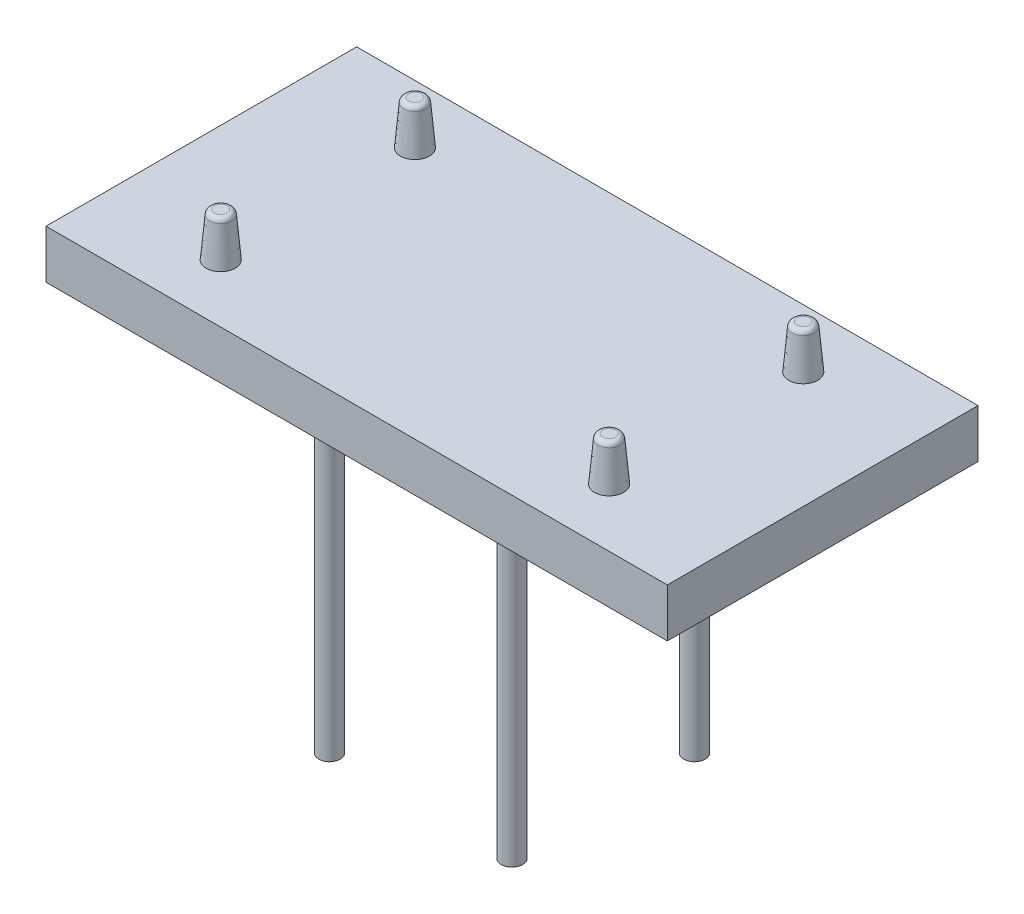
ISO-10303-21;
HEADER;
FILE_DESCRIPTION(('STEP AP214'),'2;1');
FILE_NAME('part.step','',(''),(''),'','','');
FILE_SCHEMA(('AUTOMOTIVE_DESIGN { 1 0 10303 214 1 1 1 1 }'));
ENDSEC;
DATA;
#1=APPLICATION_CONTEXT('core data for automotive mechanical design processes');
#2=APPLICATION_PROTOCOL_DEFINITION('international standard','automotive_design',2000,#1);
#3=PRODUCT_CONTEXT('',#1,'mechanical');
#4=PRODUCT('Part','Part','',(#3));
#5=PRODUCT_RELATED_PRODUCT_CATEGORY('part','',(#4));
#6=PRODUCT_DEFINITION_FORMATION('','',#4);
#7=PRODUCT_DEFINITION_CONTEXT('part definition',#1,'design');
#8=PRODUCT_DEFINITION('design','',#6,#7);
#9=PRODUCT_DEFINITION_SHAPE('','',#8);
#10=(LENGTH_UNIT() NAMED_UNIT(*) SI_UNIT(.MILLI.,.METRE.));
#11=(NAMED_UNIT(*) PLANE_ANGLE_UNIT() SI_UNIT($,.RADIAN.));
#12=(NAMED_UNIT(*) SI_UNIT($,.STERADIAN.) SOLID_ANGLE_UNIT());
#13=UNCERTAINTY_MEASURE_WITH_UNIT(LENGTH_MEASURE(1.E-05),#10,'distance_accuracy_value','');
#14=(GEOMETRIC_REPRESENTATION_CONTEXT(3) GLOBAL_UNCERTAINTY_ASSIGNED_CONTEXT((#13)) GLOBAL_UNIT_ASSIGNED_CONTEXT((#10,
#11,#12)) REPRESENTATION_CONTEXT('',''));
#15=CARTESIAN_POINT('',(0.,0.,0.));
#16=DIRECTION('',(0.,0.,1.));
#17=DIRECTION('',(1.,0.,0.));
#18=AXIS2_PLACEMENT_3D('',#15,#16,#17);
#19=CARTESIAN_POINT('',(-160.,-25.,80.));
#20=DIRECTION('',(0.,1.,0.));
#21=DIRECTION('',(0.,0.,1.));
#22=AXIS2_PLACEMENT_3D('',#19,#20,#21);
#23=PLANE('',#22);
#24=CARTESIAN_POINT('',(47.,-25.,47.));
#25=DIRECTION('',(0.,1.,0.));
#26=DIRECTION('',(0.,0.,1.));
#27=AXIS2_PLACEMENT_3D('',#24,#25,#26);
#28=CIRCLE('',#27,10.5);
#29=CARTESIAN_POINT('',(47.,-25.,57.5));
#30=VERTEX_POINT('',#29);
#31=EDGE_CURVE('E161',#30,#30,#28,.F.);
#32=ORIENTED_EDGE('',*,*,#31,.F.);
#33=EDGE_LOOP('',(#32));
#34=FACE_BOUND('',#33,.T.);
#35=CARTESIAN_POINT('',(-47.,-25.,-47.));
#36=DIRECTION('',(0.,1.,0.));
#37=DIRECTION('',(0.,0.,1.));
#38=AXIS2_PLACEMENT_3D('',#35,#36,#37);
#39=CIRCLE('',#38,10.5);
#40=CARTESIAN_POINT('',(-47.,-25.,-36.5));
#41=VERTEX_POINT('',#40);
#42=EDGE_CURVE('E147',#41,#41,#39,.F.);
#43=ORIENTED_EDGE('',*,*,#42,.F.);
#44=EDGE_LOOP('',(#43));
#45=FACE_BOUND('',#44,.T.);
#46=CARTESIAN_POINT('',(0.,-25.,0.));
#47=DIRECTION('',(0.,1.,0.));
#48=DIRECTION('',(0.,0.,1.));
#49=AXIS2_PLACEMENT_3D('',#46,#47,#48);
#50=CIRCLE('',#49,39.9999999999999);
#51=CARTESIAN_POINT('',(0.,-25.,39.9999999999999));
#52=VERTEX_POINT('',#51);
#53=EDGE_CURVE('E144',#52,#52,#50,.T.);
#54=ORIENTED_EDGE('',*,*,#53,.T.);
#55=EDGE_LOOP('',(#54));
#56=FACE_BOUND('',#55,.T.);
#57=DIRECTION('',(0.,0.,1.));
#58=VECTOR('',#57,1.);
#59=CARTESIAN_POINT('',(-160.,-25.,-80.));
#60=LINE('',#59,#58);
#61=CARTESIAN_POINT('',(-160.,-25.,-80.));
#62=VERTEX_POINT('',#61);
#63=CARTESIAN_POINT('',(-160.,-25.,80.));
#64=VERTEX_POINT('',#63);
#65=EDGE_CURVE('E100',#62,#64,#60,.T.);
#66=ORIENTED_EDGE('',*,*,#65,.F.);
#67=DIRECTION('',(1.,0.,0.));
#68=VECTOR('',#67,1.);
#69=CARTESIAN_POINT('',(-160.,-25.,-80.));
#70=LINE('',#69,#68);
#71=CARTESIAN_POINT('',(160.,-25.,-80.));
#72=VERTEX_POINT('',#71);
#73=EDGE_CURVE('E88',#62,#72,#70,.T.);
#74=ORIENTED_EDGE('',*,*,#73,.T.);
#75=DIRECTION('',(0.,0.,1.));
#76=VECTOR('',#75,1.);
#77=CARTESIAN_POINT('',(160.,-25.,-80.));
#78=LINE('',#77,#76);
#79=CARTESIAN_POINT('',(160.,-25.,80.));
#80=VERTEX_POINT('',#79);
#81=EDGE_CURVE('E83',#72,#80,#78,.T.);
#82=ORIENTED_EDGE('',*,*,#81,.T.);
#83=DIRECTION('',(1.,0.,0.));
#84=VECTOR('',#83,1.);
#85=CARTESIAN_POINT('',(-160.,-25.,80.));
#86=LINE('',#85,#84);
#87=EDGE_CURVE('E87',#64,#80,#86,.T.);
#88=ORIENTED_EDGE('',*,*,#87,.F.);
#89=EDGE_LOOP('',(#66,#74,#82,#88));
#90=FACE_BOUND('',#89,.T.);
#91=CARTESIAN_POINT('',(47.,-25.,-47.));
#92=DIRECTION('',(0.,1.,0.));
#93=DIRECTION('',(0.,0.,1.));
#94=AXIS2_PLACEMENT_3D('',#91,#92,#93);
#95=CIRCLE('',#94,10.5);
#96=CARTESIAN_POINT('',(47.,-25.,-36.5));
#97=VERTEX_POINT('',#96);
#98=EDGE_CURVE('E155',#97,#97,#95,.F.);
#99=ORIENTED_EDGE('',*,*,#98,.F.);
#100=EDGE_LOOP('',(#99));
#101=FACE_BOUND('',#100,.T.);
#102=CARTESIAN_POINT('',(-47.,-25.,47.));
#103=DIRECTION('',(0.,1.,0.));
#104=DIRECTION('',(0.,0.,1.));
#105=AXIS2_PLACEMENT_3D('',#102,#103,#104);
#106=CIRCLE('',#105,10.5);
#107=CARTESIAN_POINT('',(-47.,-25.,57.5));
#108=VERTEX_POINT('',#107);
#109=EDGE_CURVE('E167',#108,#108,#106,.F.);
#110=ORIENTED_EDGE('',*,*,#109,.F.);
#111=EDGE_LOOP('',(#110));
#112=FACE_BOUND('',#111,.T.);
#113=ADVANCED_FACE('F36',(#34,#45,#56,#90,#101,#112),#23,.F.);
#114=CARTESIAN_POINT('',(-160.,0.,80.));
#115=DIRECTION('',(0.,1.,0.));
#116=DIRECTION('',(0.,0.,1.));
#117=AXIS2_PLACEMENT_3D('',#114,#115,#116);
#118=PLANE('',#117);
#119=CARTESIAN_POINT('',(100.,0.,-50.));
#120=DIRECTION('',(0.,1.,0.));
#121=DIRECTION('',(0.,0.,1.));
#122=AXIS2_PLACEMENT_3D('',#119,#120,#121);
#123=CIRCLE('',#122,7.5);
#124=CARTESIAN_POINT('',(100.,0.,-42.5));
#125=VERTEX_POINT('',#124);
#126=EDGE_CURVE('E251',#125,#125,#123,.T.);
#127=ORIENTED_EDGE('',*,*,#126,.F.);
#128=EDGE_LOOP('',(#127));
#129=FACE_BOUND('',#128,.T.);
#130=CARTESIAN_POINT('',(-100.,0.,50.));
#131=DIRECTION('',(0.,1.,0.));
#132=DIRECTION('',(0.,0.,1.));
#133=AXIS2_PLACEMENT_3D('',#130,#131,#132);
#134=CIRCLE('',#133,7.50000000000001);
#135=CARTESIAN_POINT('',(-100.,0.,57.5));
#136=VERTEX_POINT('',#135);
#137=EDGE_CURVE('E110',#136,#136,#134,.T.);
#138=ORIENTED_EDGE('',*,*,#137,.F.);
#139=EDGE_LOOP('',(#138));
#140=FACE_BOUND('',#139,.T.);
#141=DIRECTION('',(0.,0.,1.));
#142=VECTOR('',#141,1.);
#143=CARTESIAN_POINT('',(-160.,0.,-80.));
#144=LINE('',#143,#142);
#145=CARTESIAN_POINT('',(-160.,0.,-80.));
#146=VERTEX_POINT('',#145);
#147=CARTESIAN_POINT('',(-160.,0.,80.));
#148=VERTEX_POINT('',#147);
#149=EDGE_CURVE('E106',#146,#148,#144,.T.);
#150=ORIENTED_EDGE('',*,*,#149,.T.);
#151=DIRECTION('',(1.,0.,0.));
#152=VECTOR('',#151,1.);
#153=CARTESIAN_POINT('',(-160.,0.,80.));
#154=LINE('',#153,#152);
#155=CARTESIAN_POINT('',(160.,0.,80.));
#156=VERTEX_POINT('',#155);
#157=EDGE_CURVE('E109',#148,#156,#154,.T.);
#158=ORIENTED_EDGE('',*,*,#157,.T.);
#159=DIRECTION('',(0.,0.,1.));
#160=VECTOR('',#159,1.);
#161=CARTESIAN_POINT('',(160.,0.,-80.));
#162=LINE('',#161,#160);
#163=CARTESIAN_POINT('',(160.,0.,-80.));
#164=VERTEX_POINT('',#163);
#165=EDGE_CURVE('E95',#164,#156,#162,.T.);
#166=ORIENTED_EDGE('',*,*,#165,.F.);
#167=DIRECTION('',(1.,0.,0.));
#168=VECTOR('',#167,1.);
#169=CARTESIAN_POINT('',(-160.,0.,-80.));
#170=LINE('',#169,#168);
#171=EDGE_CURVE('E70',#146,#164,#170,.T.);
#172=ORIENTED_EDGE('',*,*,#171,.F.);
#173=EDGE_LOOP('',(#150,#158,#166,#172));
#174=FACE_BOUND('',#173,.T.);
#175=CARTESIAN_POINT('',(-100.,0.,-50.));
#176=DIRECTION('',(0.,1.,0.));
#177=DIRECTION('',(0.,0.,1.));
#178=AXIS2_PLACEMENT_3D('',#175,#176,#177);
#179=CIRCLE('',#178,7.5);
#180=CARTESIAN_POINT('',(-100.,0.,-42.5));
#181=VERTEX_POINT('',#180);
#182=EDGE_CURVE('E254',#181,#181,#179,.T.);
#183=ORIENTED_EDGE('',*,*,#182,.F.);
#184=EDGE_LOOP('',(#183));
#185=FACE_BOUND('',#184,.T.);
#186=CARTESIAN_POINT('',(100.,0.,50.));
#187=DIRECTION('',(0.,1.,0.));
#188=DIRECTION('',(0.,0.,1.));
#189=AXIS2_PLACEMENT_3D('',#186,#187,#188);
#190=CIRCLE('',#189,7.50000000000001);
#191=CARTESIAN_POINT('',(100.,0.,57.5));
#192=VERTEX_POINT('',#191);
#193=EDGE_CURVE('E248',#192,#192,#190,.T.);
#194=ORIENTED_EDGE('',*,*,#193,.F.);
#195=EDGE_LOOP('',(#194));
#196=FACE_BOUND('',#195,.T.);
#197=ADVANCED_FACE('F205',(#129,#140,#174,#185,#196),#118,.T.);
#198=CARTESIAN_POINT('',(-160.,-25.,-80.));
#199=DIRECTION('',(-1.,0.,0.));
#200=DIRECTION('',(0.,0.,1.));
#201=AXIS2_PLACEMENT_3D('',#198,#199,#200);
#202=PLANE('',#201);
#203=ORIENTED_EDGE('',*,*,#149,.F.);
#204=DIRECTION('',(0.,1.,0.));
#205=VECTOR('',#204,1.);
#206=CARTESIAN_POINT('',(-160.,-25.,-80.));
#207=LINE('',#206,#205);
#208=EDGE_CURVE('E53',#62,#146,#207,.T.);
#209=ORIENTED_EDGE('',*,*,#208,.F.);
#210=ORIENTED_EDGE('',*,*,#65,.T.);
#211=DIRECTION('',(0.,1.,0.));
#212=VECTOR('',#211,1.);
#213=CARTESIAN_POINT('',(-160.,-25.,80.));
#214=LINE('',#213,#212);
#215=EDGE_CURVE('E78',#64,#148,#214,.T.);
#216=ORIENTED_EDGE('',*,*,#215,.T.);
#217=EDGE_LOOP('',(#203,#209,#210,#216));
#218=FACE_BOUND('',#217,.T.);
#219=ADVANCED_FACE('F212',(#218),#202,.T.);
#220=CARTESIAN_POINT('',(-160.,-25.,-80.));
#221=DIRECTION('',(0.,0.,1.));
#222=DIRECTION('',(1.,0.,0.));
#223=AXIS2_PLACEMENT_3D('',#220,#221,#222);
#224=PLANE('',#223);
#225=ORIENTED_EDGE('',*,*,#171,.T.);
#226=DIRECTION('',(0.,1.,0.));
#227=VECTOR('',#226,1.);
#228=CARTESIAN_POINT('',(160.,-25.,-80.));
#229=LINE('',#228,#227);
#230=EDGE_CURVE('E97',#72,#164,#229,.T.);
#231=ORIENTED_EDGE('',*,*,#230,.F.);
#232=ORIENTED_EDGE('',*,*,#73,.F.);
#233=ORIENTED_EDGE('',*,*,#208,.T.);
#234=EDGE_LOOP('',(#225,#231,#232,#233));
#235=FACE_BOUND('',#234,.T.);
#236=ADVANCED_FACE('F538',(#235),#224,.F.);
#237=CARTESIAN_POINT('',(160.,-25.,-80.));
#238=DIRECTION('',(-1.,0.,0.));
#239=DIRECTION('',(0.,0.,1.));
#240=AXIS2_PLACEMENT_3D('',#237,#238,#239);
#241=PLANE('',#240);
#242=ORIENTED_EDGE('',*,*,#165,.T.);
#243=DIRECTION('',(0.,1.,0.));
#244=VECTOR('',#243,1.);
#245=CARTESIAN_POINT('',(160.,-25.,80.));
#246=LINE('',#245,#244);
#247=EDGE_CURVE('E92',#80,#156,#246,.T.);
#248=ORIENTED_EDGE('',*,*,#247,.F.);
#249=ORIENTED_EDGE('',*,*,#81,.F.);
#250=ORIENTED_EDGE('',*,*,#230,.T.);
#251=EDGE_LOOP('',(#242,#248,#249,#250));
#252=FACE_BOUND('',#251,.T.);
#253=ADVANCED_FACE('F93',(#252),#241,.F.);
#254=CARTESIAN_POINT('',(-160.,-25.,80.));
#255=DIRECTION('',(0.,0.,1.));
#256=DIRECTION('',(1.,0.,0.));
#257=AXIS2_PLACEMENT_3D('',#254,#255,#256);
#258=PLANE('',#257);
#259=ORIENTED_EDGE('',*,*,#157,.F.);
#260=ORIENTED_EDGE('',*,*,#215,.F.);
#261=ORIENTED_EDGE('',*,*,#87,.T.);
#262=ORIENTED_EDGE('',*,*,#247,.T.);
#263=EDGE_LOOP('',(#259,#260,#261,#262));
#264=FACE_BOUND('',#263,.T.);
#265=ADVANCED_FACE('F99',(#264),#258,.T.);
#266=CARTESIAN_POINT('',(-100.,0.,50.));
#267=DIRECTION('',(0.,-1.,0.));
#268=DIRECTION('',(0.,0.,1.));
#269=AXIS2_PLACEMENT_3D('',#266,#267,#268);
#270=CONICAL_SURFACE('',#269,7.50000000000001,0.0872664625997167);
#271=CARTESIAN_POINT('',(-100.,20.2178893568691,50.));
#272=DIRECTION('',(0.,-1.,0.));
#273=DIRECTION('',(0.,0.,-1.));
#274=AXIS2_PLACEMENT_3D('',#271,#272,#273);
#275=CIRCLE('',#274,5.73116388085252);
#276=CARTESIAN_POINT('',(-100.,20.2178893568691,44.2688361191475));
#277=VERTEX_POINT('',#276);
#278=EDGE_CURVE('E138',#277,#277,#275,.T.);
#279=ORIENTED_EDGE('',*,*,#278,.T.);
#280=EDGE_LOOP('',(#279));
#281=FACE_BOUND('',#280,.T.);
#282=ORIENTED_EDGE('',*,*,#137,.T.);
#283=EDGE_LOOP('',(#282));
#284=FACE_BOUND('',#283,.T.);
#285=ADVANCED_FACE('F259',(#281,#284),#270,.T.);
#286=CARTESIAN_POINT('',(-100.,22.5,50.));
#287=DIRECTION('',(0.,1.,0.));
#288=DIRECTION('',(0.,0.,1.));
#289=AXIS2_PLACEMENT_3D('',#286,#287,#288);
#290=PLANE('',#289);
#291=CARTESIAN_POINT('',(-100.,22.5,50.));
#292=DIRECTION('',(0.,1.,0.));
#293=DIRECTION('',(0.,0.,1.));
#294=AXIS2_PLACEMENT_3D('',#291,#292,#293);
#295=CIRCLE('',#294,3.24067713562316);
#296=CARTESIAN_POINT('',(-100.,22.5,53.2406771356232));
#297=VERTEX_POINT('',#296);
#298=EDGE_CURVE('E135',#297,#297,#295,.T.);
#299=ORIENTED_EDGE('',*,*,#298,.T.);
#300=EDGE_LOOP('',(#299));
#301=FACE_BOUND('',#300,.T.);
#302=ADVANCED_FACE('F293',(#301),#290,.T.);
#303=CARTESIAN_POINT('',(-100.,0.,-50.));
#304=DIRECTION('',(0.,-1.,0.));
#305=DIRECTION('',(0.,0.,1.));
#306=AXIS2_PLACEMENT_3D('',#303,#304,#305);
#307=CONICAL_SURFACE('',#306,7.5,0.0872664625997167);
#308=CARTESIAN_POINT('',(-100.,20.2178893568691,-50.));
#309=DIRECTION('',(0.,-1.,0.));
#310=DIRECTION('',(0.,0.,-1.));
#311=AXIS2_PLACEMENT_3D('',#308,#309,#310);
#312=CIRCLE('',#311,5.73116388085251);
#313=CARTESIAN_POINT('',(-100.,20.2178893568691,-55.7311638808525));
#314=VERTEX_POINT('',#313);
#315=EDGE_CURVE('E132',#314,#314,#312,.T.);
#316=ORIENTED_EDGE('',*,*,#315,.T.);
#317=EDGE_LOOP('',(#316));
#318=FACE_BOUND('',#317,.T.);
#319=ORIENTED_EDGE('',*,*,#182,.T.);
#320=EDGE_LOOP('',(#319));
#321=FACE_BOUND('',#320,.T.);
#322=ADVANCED_FACE('F290',(#318,#321),#307,.T.);
#323=CARTESIAN_POINT('',(-100.,22.5,-50.));
#324=DIRECTION('',(0.,1.,0.));
#325=DIRECTION('',(0.,0.,1.));
#326=AXIS2_PLACEMENT_3D('',#323,#324,#325);
#327=PLANE('',#326);
#328=CARTESIAN_POINT('',(-100.,22.5,-50.));
#329=DIRECTION('',(0.,1.,0.));
#330=DIRECTION('',(0.,0.,1.));
#331=AXIS2_PLACEMENT_3D('',#328,#329,#330);
#332=CIRCLE('',#331,3.24067713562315);
#333=CARTESIAN_POINT('',(-100.,22.5,-46.7593228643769));
#334=VERTEX_POINT('',#333);
#335=EDGE_CURVE('E129',#334,#334,#332,.T.);
#336=ORIENTED_EDGE('',*,*,#335,.T.);
#337=EDGE_LOOP('',(#336));
#338=FACE_BOUND('',#337,.T.);
#339=ADVANCED_FACE('F287',(#338),#327,.T.);
#340=CARTESIAN_POINT('',(100.,0.,-50.));
#341=DIRECTION('',(0.,-1.,0.));
#342=DIRECTION('',(0.,0.,1.));
#343=AXIS2_PLACEMENT_3D('',#340,#341,#342);
#344=CONICAL_SURFACE('',#343,7.5,0.0872664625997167);
#345=CARTESIAN_POINT('',(100.,20.2178893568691,-50.));
#346=DIRECTION('',(0.,-1.,0.));
#347=DIRECTION('',(0.,0.,-1.));
#348=AXIS2_PLACEMENT_3D('',#345,#346,#347);
#349=CIRCLE('',#348,5.73116388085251);
#350=CARTESIAN_POINT('',(100.,20.2178893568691,-55.7311638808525));
#351=VERTEX_POINT('',#350);
#352=EDGE_CURVE('E126',#351,#351,#349,.T.);
#353=ORIENTED_EDGE('',*,*,#352,.T.);
#354=EDGE_LOOP('',(#353));
#355=FACE_BOUND('',#354,.T.);
#356=ORIENTED_EDGE('',*,*,#126,.T.);
#357=EDGE_LOOP('',(#356));
#358=FACE_BOUND('',#357,.T.);
#359=ADVANCED_FACE('F280',(#355,#358),#344,.T.);
#360=CARTESIAN_POINT('',(100.,22.5,-50.));
#361=DIRECTION('',(0.,1.,0.));
#362=DIRECTION('',(0.,0.,1.));
#363=AXIS2_PLACEMENT_3D('',#360,#361,#362);
#364=PLANE('',#363);
#365=CARTESIAN_POINT('',(100.,22.5,-50.));
#366=DIRECTION('',(0.,1.,0.));
#367=DIRECTION('',(0.,0.,1.));
#368=AXIS2_PLACEMENT_3D('',#365,#366,#367);
#369=CIRCLE('',#368,3.24067713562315);
#370=CARTESIAN_POINT('',(100.,22.5,-46.7593228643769));
#371=VERTEX_POINT('',#370);
#372=EDGE_CURVE('E123',#371,#371,#369,.T.);
#373=ORIENTED_EDGE('',*,*,#372,.T.);
#374=EDGE_LOOP('',(#373));
#375=FACE_BOUND('',#374,.T.);
#376=ADVANCED_FACE('F270',(#375),#364,.T.);
#377=CARTESIAN_POINT('',(100.,0.,50.));
#378=DIRECTION('',(0.,-1.,0.));
#379=DIRECTION('',(0.,0.,1.));
#380=AXIS2_PLACEMENT_3D('',#377,#378,#379);
#381=CONICAL_SURFACE('',#380,7.50000000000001,0.0872664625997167);
#382=CARTESIAN_POINT('',(100.,20.2178893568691,50.));
#383=DIRECTION('',(0.,-1.,0.));
#384=DIRECTION('',(0.,0.,-1.));
#385=AXIS2_PLACEMENT_3D('',#382,#383,#384);
#386=CIRCLE('',#385,5.73116388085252);
#387=CARTESIAN_POINT('',(100.,20.2178893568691,44.2688361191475));
#388=VERTEX_POINT('',#387);
#389=EDGE_CURVE('E120',#388,#388,#386,.T.);
#390=ORIENTED_EDGE('',*,*,#389,.T.);
#391=EDGE_LOOP('',(#390));
#392=FACE_BOUND('',#391,.T.);
#393=ORIENTED_EDGE('',*,*,#193,.T.);
#394=EDGE_LOOP('',(#393));
#395=FACE_BOUND('',#394,.T.);
#396=ADVANCED_FACE('F267',(#392,#395),#381,.T.);
#397=CARTESIAN_POINT('',(100.,22.5,50.));
#398=DIRECTION('',(0.,1.,0.));
#399=DIRECTION('',(0.,0.,1.));
#400=AXIS2_PLACEMENT_3D('',#397,#398,#399);
#401=PLANE('',#400);
#402=CARTESIAN_POINT('',(100.,22.5,50.));
#403=DIRECTION('',(0.,1.,0.));
#404=DIRECTION('',(0.,0.,1.));
#405=AXIS2_PLACEMENT_3D('',#402,#403,#404);
#406=CIRCLE('',#405,3.24067713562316);
#407=CARTESIAN_POINT('',(100.,22.5,53.2406771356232));
#408=VERTEX_POINT('',#407);
#409=EDGE_CURVE('E115',#408,#408,#406,.T.);
#410=ORIENTED_EDGE('',*,*,#409,.T.);
#411=EDGE_LOOP('',(#410));
#412=FACE_BOUND('',#411,.T.);
#413=ADVANCED_FACE('F269',(#412),#401,.T.);
#414=CARTESIAN_POINT('',(100.,20.,50.));
#415=DIRECTION('',(0.,1.,0.));
#416=DIRECTION('',(0.,0.,1.));
#417=AXIS2_PLACEMENT_3D('',#414,#415,#416);
#418=TOROIDAL_SURFACE('',#417,3.24067713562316,2.5);
#419=ORIENTED_EDGE('',*,*,#389,.F.);
#420=EDGE_LOOP('',(#419));
#421=FACE_BOUND('',#420,.T.);
#422=ORIENTED_EDGE('',*,*,#409,.F.);
#423=EDGE_LOOP('',(#422));
#424=FACE_BOUND('',#423,.T.);
#425=ADVANCED_FACE('F277',(#421,#424),#418,.T.);
#426=CARTESIAN_POINT('',(100.,20.,-50.));
#427=DIRECTION('',(0.,1.,0.));
#428=DIRECTION('',(0.,0.,1.));
#429=AXIS2_PLACEMENT_3D('',#426,#427,#428);
#430=TOROIDAL_SURFACE('',#429,3.24067713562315,2.5);
#431=ORIENTED_EDGE('',*,*,#352,.F.);
#432=EDGE_LOOP('',(#431));
#433=FACE_BOUND('',#432,.T.);
#434=ORIENTED_EDGE('',*,*,#372,.F.);
#435=EDGE_LOOP('',(#434));
#436=FACE_BOUND('',#435,.T.);
#437=ADVANCED_FACE('F320',(#433,#436),#430,.T.);
#438=CARTESIAN_POINT('',(-100.,20.,-50.));
#439=DIRECTION('',(0.,1.,0.));
#440=DIRECTION('',(0.,0.,1.));
#441=AXIS2_PLACEMENT_3D('',#438,#439,#440);
#442=TOROIDAL_SURFACE('',#441,3.24067713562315,2.5);
#443=ORIENTED_EDGE('',*,*,#315,.F.);
#444=EDGE_LOOP('',(#443));
#445=FACE_BOUND('',#444,.T.);
#446=ORIENTED_EDGE('',*,*,#335,.F.);
#447=EDGE_LOOP('',(#446));
#448=FACE_BOUND('',#447,.T.);
#449=ADVANCED_FACE('F312',(#445,#448),#442,.T.);
#450=CARTESIAN_POINT('',(-100.,20.,50.));
#451=DIRECTION('',(0.,1.,0.));
#452=DIRECTION('',(0.,0.,1.));
#453=AXIS2_PLACEMENT_3D('',#450,#451,#452);
#454=TOROIDAL_SURFACE('',#453,3.24067713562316,2.5);
#455=ORIENTED_EDGE('',*,*,#278,.F.);
#456=EDGE_LOOP('',(#455));
#457=FACE_BOUND('',#456,.T.);
#458=ORIENTED_EDGE('',*,*,#298,.F.);
#459=EDGE_LOOP('',(#458));
#460=FACE_BOUND('',#459,.T.);
#461=ADVANCED_FACE('F308',(#457,#460),#454,.T.);
#462=CARTESIAN_POINT('',(0.,-50.,0.));
#463=DIRECTION('',(0.,-1.,0.));
#464=DIRECTION('',(0.,0.,-1.));
#465=AXIS2_PLACEMENT_3D('',#462,#463,#464);
#466=PLANE('',#465);
#467=CARTESIAN_POINT('',(0.,-50.,0.));
#468=DIRECTION('',(0.,-1.,0.));
#469=DIRECTION('',(0.,0.,-1.));
#470=AXIS2_PLACEMENT_3D('',#467,#468,#469);
#471=CIRCLE('',#470,30.);
#472=CARTESIAN_POINT('',(0.,-50.,-30.));
#473=VERTEX_POINT('',#472);
#474=EDGE_CURVE('E240',#473,#473,#471,.T.);
#475=ORIENTED_EDGE('',*,*,#474,.T.);
#476=EDGE_LOOP('',(#475));
#477=FACE_BOUND('',#476,.T.);
#478=CARTESIAN_POINT('',(0.,-50.,0.));
#479=DIRECTION('',(0.,-1.,0.));
#480=DIRECTION('',(0.,0.,-1.));
#481=AXIS2_PLACEMENT_3D('',#478,#479,#480);
#482=CIRCLE('',#481,15.);
#483=CARTESIAN_POINT('',(0.,-50.,-15.));
#484=VERTEX_POINT('',#483);
#485=EDGE_CURVE('E236',#484,#484,#482,.T.);
#486=ORIENTED_EDGE('',*,*,#485,.F.);
#487=EDGE_LOOP('',(#486));
#488=FACE_BOUND('',#487,.T.);
#489=ADVANCED_FACE('F311',(#477,#488),#466,.T.);
#490=CARTESIAN_POINT('',(0.,-50.,0.));
#491=DIRECTION('',(0.,1.,0.));
#492=DIRECTION('',(0.,0.,1.));
#493=AXIS2_PLACEMENT_3D('',#490,#491,#492);
#494=CYLINDRICAL_SURFACE('',#493,30.);
#495=CARTESIAN_POINT('',(0.,-35.,0.));
#496=DIRECTION('',(0.,1.,0.));
#497=DIRECTION('',(0.,0.,1.));
#498=AXIS2_PLACEMENT_3D('',#495,#496,#497);
#499=CIRCLE('',#498,30.);
#500=CARTESIAN_POINT('',(0.,-35.,30.));
#501=VERTEX_POINT('',#500);
#502=EDGE_CURVE('E141',#501,#501,#499,.F.);
#503=ORIENTED_EDGE('',*,*,#502,.T.);
#504=EDGE_LOOP('',(#503));
#505=FACE_BOUND('',#504,.T.);
#506=ORIENTED_EDGE('',*,*,#474,.F.);
#507=EDGE_LOOP('',(#506));
#508=FACE_BOUND('',#507,.T.);
#509=ADVANCED_FACE('F229',(#505,#508),#494,.T.);
#510=CARTESIAN_POINT('',(0.,-50.,0.));
#511=DIRECTION('',(0.,1.,0.));
#512=DIRECTION('',(0.,0.,1.));
#513=AXIS2_PLACEMENT_3D('',#510,#511,#512);
#514=CYLINDRICAL_SURFACE('',#513,15.);
#515=ORIENTED_EDGE('',*,*,#485,.T.);
#516=EDGE_LOOP('',(#515));
#517=FACE_BOUND('',#516,.T.);
#518=CARTESIAN_POINT('',(0.,-25.,0.));
#519=DIRECTION('',(0.,-1.,0.));
#520=DIRECTION('',(0.,0.,-1.));
#521=AXIS2_PLACEMENT_3D('',#518,#519,#520);
#522=CIRCLE('',#521,15.);
#523=CARTESIAN_POINT('',(0.,-25.,-15.));
#524=VERTEX_POINT('',#523);
#525=EDGE_CURVE('E234',#524,#524,#522,.T.);
#526=ORIENTED_EDGE('',*,*,#525,.F.);
#527=EDGE_LOOP('',(#526));
#528=FACE_BOUND('',#527,.T.);
#529=ADVANCED_FACE('F220',(#517,#528),#514,.F.);
#530=ORIENTED_EDGE('',*,*,#525,.T.);
#531=EDGE_LOOP('',(#530));
#532=FACE_BOUND('',#531,.T.);
#533=ADVANCED_FACE('F208',(#532),#23,.F.);
#534=CARTESIAN_POINT('',(0.,-35.,0.));
#535=DIRECTION('',(0.,1.,0.));
#536=DIRECTION('',(0.,0.,1.));
#537=AXIS2_PLACEMENT_3D('',#534,#535,#536);
#538=CONICAL_SURFACE('',#537,30.,0.785398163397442);
#539=CARTESIAN_POINT('',(0.,-25.,39.9999999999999));
#540=CARTESIAN_POINT('',(0.,-25.1041666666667,39.8958333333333));
#541=CARTESIAN_POINT('',(0.,-25.2083333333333,39.7916666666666));
#542=CARTESIAN_POINT('',(0.,-25.4166666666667,39.5833333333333));
#543=CARTESIAN_POINT('',(0.,-25.5208333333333,39.4791666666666));
#544=CARTESIAN_POINT('',(0.,-25.7291666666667,39.2708333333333));
#545=CARTESIAN_POINT('',(0.,-25.8333333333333,39.1666666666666));
#546=CARTESIAN_POINT('',(0.,-26.0416666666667,38.9583333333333));
#547=CARTESIAN_POINT('',(0.,-26.1458333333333,38.8541666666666));
#548=CARTESIAN_POINT('',(0.,-26.3541666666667,38.6458333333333));
#549=CARTESIAN_POINT('',(0.,-26.4583333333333,38.5416666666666));
#550=CARTESIAN_POINT('',(0.,-26.6666666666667,38.3333333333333));
#551=CARTESIAN_POINT('',(0.,-26.7708333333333,38.2291666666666));
#552=CARTESIAN_POINT('',(0.,-26.9791666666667,38.0208333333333));
#553=CARTESIAN_POINT('',(0.,-27.0833333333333,37.9166666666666));
#554=CARTESIAN_POINT('',(0.,-27.2916666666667,37.7083333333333));
#555=CARTESIAN_POINT('',(0.,-27.3958333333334,37.6041666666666));
#556=CARTESIAN_POINT('',(0.,-27.6041666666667,37.3958333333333));
#557=CARTESIAN_POINT('',(0.,-27.7083333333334,37.2916666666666));
#558=CARTESIAN_POINT('',(0.,-27.9166666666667,37.0833333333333));
#559=CARTESIAN_POINT('',(0.,-28.0208333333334,36.9791666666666));
#560=CARTESIAN_POINT('',(0.,-28.2291666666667,36.7708333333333));
#561=CARTESIAN_POINT('',(0.,-28.3333333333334,36.6666666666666));
#562=CARTESIAN_POINT('',(0.,-28.5416666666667,36.4583333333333));
#563=CARTESIAN_POINT('',(0.,-28.6458333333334,36.3541666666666));
#564=CARTESIAN_POINT('',(0.,-28.8541666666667,36.1458333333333));
#565=CARTESIAN_POINT('',(0.,-28.9583333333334,36.0416666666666));
#566=CARTESIAN_POINT('',(0.,-29.1666666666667,35.8333333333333));
#567=CARTESIAN_POINT('',(0.,-29.2708333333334,35.7291666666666));
#568=CARTESIAN_POINT('',(0.,-29.4791666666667,35.5208333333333));
#569=CARTESIAN_POINT('',(0.,-29.5833333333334,35.4166666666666));
#570=CARTESIAN_POINT('',(0.,-29.7916666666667,35.2083333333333));
#571=CARTESIAN_POINT('',(0.,-29.8958333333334,35.1041666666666));
#572=CARTESIAN_POINT('',(0.,-30.1041666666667,34.8958333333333));
#573=CARTESIAN_POINT('',(0.,-30.2083333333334,34.7916666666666));
#574=CARTESIAN_POINT('',(0.,-30.4166666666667,34.5833333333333));
#575=CARTESIAN_POINT('',(0.,-30.5208333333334,34.4791666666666));
#576=CARTESIAN_POINT('',(0.,-30.7291666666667,34.2708333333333));
#577=CARTESIAN_POINT('',(0.,-30.8333333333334,34.1666666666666));
#578=CARTESIAN_POINT('',(0.,-31.0416666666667,33.9583333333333));
#579=CARTESIAN_POINT('',(0.,-31.1458333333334,33.8541666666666));
#580=CARTESIAN_POINT('',(0.,-31.3541666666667,33.6458333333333));
#581=CARTESIAN_POINT('',(0.,-31.4583333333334,33.5416666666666));
#582=CARTESIAN_POINT('',(0.,-31.6666666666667,33.3333333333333));
#583=CARTESIAN_POINT('',(0.,-31.7708333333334,33.2291666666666));
#584=CARTESIAN_POINT('',(0.,-31.9791666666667,33.0208333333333));
#585=CARTESIAN_POINT('',(0.,-32.0833333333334,32.9166666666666));
#586=CARTESIAN_POINT('',(0.,-32.2916666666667,32.7083333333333));
#587=CARTESIAN_POINT('',(0.,-32.3958333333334,32.6041666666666));
#588=CARTESIAN_POINT('',(0.,-32.6041666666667,32.3958333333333));
#589=CARTESIAN_POINT('',(0.,-32.7083333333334,32.2916666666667));
#590=CARTESIAN_POINT('',(0.,-32.9166666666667,32.0833333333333));
#591=CARTESIAN_POINT('',(0.,-33.0208333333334,31.9791666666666));
#592=CARTESIAN_POINT('',(0.,-33.2291666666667,31.7708333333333));
#593=CARTESIAN_POINT('',(0.,-33.3333333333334,31.6666666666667));
#594=CARTESIAN_POINT('',(0.,-33.5416666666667,31.4583333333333));
#595=CARTESIAN_POINT('',(0.,-33.6458333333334,31.3541666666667));
#596=CARTESIAN_POINT('',(0.,-33.8541666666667,31.1458333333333));
#597=CARTESIAN_POINT('',(0.,-33.9583333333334,31.0416666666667));
#598=CARTESIAN_POINT('',(0.,-34.1666666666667,30.8333333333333));
#599=CARTESIAN_POINT('',(0.,-34.2708333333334,30.7291666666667));
#600=CARTESIAN_POINT('',(0.,-34.4791666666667,30.5208333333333));
#601=CARTESIAN_POINT('',(0.,-34.5833333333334,30.4166666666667));
#602=CARTESIAN_POINT('',(0.,-34.7916666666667,30.2083333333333));
#603=CARTESIAN_POINT('',(0.,-34.8958333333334,30.1041666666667));
#604=CARTESIAN_POINT('',(0.,-35.,30.));
#605=B_SPLINE_CURVE_WITH_KNOTS('',3,(#539,#540,#541,#542,#543,#544,#545,#546,#547,#548,#549,
#550,#551,#552,#553,#554,#555,#556,#557,#558,#559,#560,#561,#562,#563,#564,#565,#566,#567,#568,
#569,#570,#571,#572,#573,#574,#575,#576,#577,#578,#579,#580,#581,#582,#583,#584,#585,#586,#587,
#588,#589,#590,#591,#592,#593,#594,#595,#596,#597,#598,#599,#600,#601,#602,#603,#604),
.UNSPECIFIED.,.F.,.F.,(4,2,2,2,2,2,2,2,2,2,2,2,2,2,2,2,2,2,2,2,2,2,2,2,2,2,2,2,2,2,2,2,4),(0.,
0.441941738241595,0.88388347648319,1.32582521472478,1.76776695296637,2.20970869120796,
2.65165042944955,3.09359216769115,3.53553390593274,3.97747564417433,4.41941738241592,
4.86135912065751,5.3033008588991,5.74524259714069,6.18718433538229,6.62912607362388,
7.07106781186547,7.51300955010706,7.95495128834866,8.39689302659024,8.83883476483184,
9.28077650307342,9.72271824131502,10.1646599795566,10.6066017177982,11.0485434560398,
11.4904851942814,11.932426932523,12.3743686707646,12.8163104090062,13.2582521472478,
13.7001938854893,14.1421356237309),.UNSPECIFIED.);
#606=EDGE_CURVE('BSEAM219',#52,#501,#605,.T.);
#607=ORIENTED_EDGE('',*,*,#53,.F.);
#608=ORIENTED_EDGE('',*,*,#502,.F.);
#609=ORIENTED_EDGE('',*,*,#606,.T.);
#610=ORIENTED_EDGE('',*,*,#606,.F.);
#611=EDGE_LOOP('',(#607,#609,#608,#610));
#612=FACE_BOUND('',#611,.T.);
#613=ADVANCED_FACE('F219',(#612),#538,.T.);
#614=CARTESIAN_POINT('',(-47.,-40.,-47.));
#615=DIRECTION('',(0.,-1.,0.));
#616=DIRECTION('',(0.,0.,-1.));
#617=AXIS2_PLACEMENT_3D('',#614,#615,#616);
#618=PLANE('',#617);
#619=CARTESIAN_POINT('',(-47.,-40.,-47.));
#620=DIRECTION('',(0.,-1.,0.));
#621=DIRECTION('',(0.,0.,-1.));
#622=AXIS2_PLACEMENT_3D('',#619,#620,#621);
#623=CIRCLE('',#622,8.50000000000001);
#624=CARTESIAN_POINT('',(-47.,-40.,-55.5));
#625=VERTEX_POINT('',#624);
#626=EDGE_CURVE('E184',#625,#625,#623,.T.);
#627=ORIENTED_EDGE('',*,*,#626,.T.);
#628=EDGE_LOOP('',(#627));
#629=FACE_BOUND('',#628,.T.);
#630=CARTESIAN_POINT('',(-47.,-40.,-47.));
#631=DIRECTION('',(0.,-1.,0.));
#632=DIRECTION('',(0.,0.,-1.));
#633=AXIS2_PLACEMENT_3D('',#630,#631,#632);
#634=CIRCLE('',#633,5.5);
#635=CARTESIAN_POINT('',(-47.,-40.,-52.5));
#636=VERTEX_POINT('',#635);
#637=EDGE_CURVE('E148',#636,#636,#634,.T.);
#638=ORIENTED_EDGE('',*,*,#637,.F.);
#639=EDGE_LOOP('',(#638));
#640=FACE_BOUND('',#639,.T.);
#641=ADVANCED_FACE('F226',(#629,#640),#618,.T.);
#642=CARTESIAN_POINT('',(-47.,-40.,-47.));
#643=DIRECTION('',(0.,1.,0.));
#644=DIRECTION('',(0.,0.,1.));
#645=AXIS2_PLACEMENT_3D('',#642,#643,#644);
#646=CYLINDRICAL_SURFACE('',#645,10.5);
#647=CARTESIAN_POINT('',(-47.,-38.,-47.));
#648=DIRECTION('',(0.,-1.,0.));
#649=DIRECTION('',(0.,0.,-1.));
#650=AXIS2_PLACEMENT_3D('',#647,#648,#649);
#651=CIRCLE('',#650,10.5);
#652=CARTESIAN_POINT('',(-47.,-38.,-57.5));
#653=VERTEX_POINT('',#652);
#654=EDGE_CURVE('E187',#653,#653,#651,.F.);
#655=ORIENTED_EDGE('',*,*,#654,.T.);
#656=EDGE_LOOP('',(#655));
#657=FACE_BOUND('',#656,.T.);
#658=ORIENTED_EDGE('',*,*,#42,.T.);
#659=EDGE_LOOP('',(#658));
#660=FACE_BOUND('',#659,.T.);
#661=ADVANCED_FACE('F371',(#657,#660),#646,.T.);
#662=CARTESIAN_POINT('',(-47.,-195.,-47.));
#663=DIRECTION('',(0.,-1.,0.));
#664=DIRECTION('',(0.,0.,-1.));
#665=AXIS2_PLACEMENT_3D('',#662,#663,#664);
#666=PLANE('',#665);
#667=CARTESIAN_POINT('',(-47.,-195.,-47.));
#668=DIRECTION('',(0.,-1.,0.));
#669=DIRECTION('',(0.,0.,-1.));
#670=AXIS2_PLACEMENT_3D('',#667,#668,#669);
#671=CIRCLE('',#670,5.5);
#672=CARTESIAN_POINT('',(-47.,-195.,-52.5));
#673=VERTEX_POINT('',#672);
#674=EDGE_CURVE('E151',#673,#673,#671,.T.);
#675=ORIENTED_EDGE('',*,*,#674,.T.);
#676=EDGE_LOOP('',(#675));
#677=FACE_BOUND('',#676,.T.);
#678=ADVANCED_FACE('F363',(#677),#666,.T.);
#679=CARTESIAN_POINT('',(-47.,-195.,-47.));
#680=DIRECTION('',(0.,1.,0.));
#681=DIRECTION('',(0.,0.,1.));
#682=AXIS2_PLACEMENT_3D('',#679,#680,#681);
#683=CYLINDRICAL_SURFACE('',#682,5.5);
#684=ORIENTED_EDGE('',*,*,#637,.T.);
#685=EDGE_LOOP('',(#684));
#686=FACE_BOUND('',#685,.T.);
#687=ORIENTED_EDGE('',*,*,#674,.F.);
#688=EDGE_LOOP('',(#687));
#689=FACE_BOUND('',#688,.T.);
#690=ADVANCED_FACE('F342',(#686,#689),#683,.T.);
#691=CARTESIAN_POINT('',(47.,-40.,-47.));
#692=DIRECTION('',(0.,-1.,0.));
#693=DIRECTION('',(0.,0.,-1.));
#694=AXIS2_PLACEMENT_3D('',#691,#692,#693);
#695=PLANE('',#694);
#696=CARTESIAN_POINT('',(47.,-40.,-47.));
#697=DIRECTION('',(0.,-1.,0.));
#698=DIRECTION('',(0.,0.,-1.));
#699=AXIS2_PLACEMENT_3D('',#696,#697,#698);
#700=CIRCLE('',#699,8.50000000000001);
#701=CARTESIAN_POINT('',(47.,-40.,-55.5));
#702=VERTEX_POINT('',#701);
#703=EDGE_CURVE('E178',#702,#702,#700,.T.);
#704=ORIENTED_EDGE('',*,*,#703,.T.);
#705=EDGE_LOOP('',(#704));
#706=FACE_BOUND('',#705,.T.);
#707=CARTESIAN_POINT('',(47.,-40.,-47.));
#708=DIRECTION('',(0.,-1.,0.));
#709=DIRECTION('',(0.,0.,-1.));
#710=AXIS2_PLACEMENT_3D('',#707,#708,#709);
#711=CIRCLE('',#710,5.5);
#712=CARTESIAN_POINT('',(47.,-40.,-52.5));
#713=VERTEX_POINT('',#712);
#714=EDGE_CURVE('E152',#713,#713,#711,.T.);
#715=ORIENTED_EDGE('',*,*,#714,.F.);
#716=EDGE_LOOP('',(#715));
#717=FACE_BOUND('',#716,.T.);
#718=ADVANCED_FACE('F338',(#706,#717),#695,.T.);
#719=CARTESIAN_POINT('',(47.,-40.,-47.));
#720=DIRECTION('',(0.,1.,0.));
#721=DIRECTION('',(0.,0.,1.));
#722=AXIS2_PLACEMENT_3D('',#719,#720,#721);
#723=CYLINDRICAL_SURFACE('',#722,10.5);
#724=CARTESIAN_POINT('',(47.,-38.,-47.));
#725=DIRECTION('',(0.,-1.,0.));
#726=DIRECTION('',(0.,0.,-1.));
#727=AXIS2_PLACEMENT_3D('',#724,#725,#726);
#728=CIRCLE('',#727,10.5);
#729=CARTESIAN_POINT('',(47.,-38.,-57.5));
#730=VERTEX_POINT('',#729);
#731=EDGE_CURVE('E181',#730,#730,#728,.F.);
#732=ORIENTED_EDGE('',*,*,#731,.T.);
#733=EDGE_LOOP('',(#732));
#734=FACE_BOUND('',#733,.T.);
#735=ORIENTED_EDGE('',*,*,#98,.T.);
#736=EDGE_LOOP('',(#735));
#737=FACE_BOUND('',#736,.T.);
#738=ADVANCED_FACE('F341',(#734,#737),#723,.T.);
#739=CARTESIAN_POINT('',(47.,-195.,-47.));
#740=DIRECTION('',(0.,-1.,0.));
#741=DIRECTION('',(0.,0.,-1.));
#742=AXIS2_PLACEMENT_3D('',#739,#740,#741);
#743=PLANE('',#742);
#744=CARTESIAN_POINT('',(47.,-195.,-47.));
#745=DIRECTION('',(0.,-1.,0.));
#746=DIRECTION('',(0.,0.,-1.));
#747=AXIS2_PLACEMENT_3D('',#744,#745,#746);
#748=CIRCLE('',#747,5.5);
#749=CARTESIAN_POINT('',(47.,-195.,-52.5));
#750=VERTEX_POINT('',#749);
#751=EDGE_CURVE('E354',#750,#750,#748,.T.);
#752=ORIENTED_EDGE('',*,*,#751,.T.);
#753=EDGE_LOOP('',(#752));
#754=FACE_BOUND('',#753,.T.);
#755=ADVANCED_FACE('F350',(#754),#743,.T.);
#756=CARTESIAN_POINT('',(47.,-195.,-47.));
#757=DIRECTION('',(0.,1.,0.));
#758=DIRECTION('',(0.,0.,1.));
#759=AXIS2_PLACEMENT_3D('',#756,#757,#758);
#760=CYLINDRICAL_SURFACE('',#759,5.5);
#761=ORIENTED_EDGE('',*,*,#714,.T.);
#762=EDGE_LOOP('',(#761));
#763=FACE_BOUND('',#762,.T.);
#764=ORIENTED_EDGE('',*,*,#751,.F.);
#765=EDGE_LOOP('',(#764));
#766=FACE_BOUND('',#765,.T.);
#767=ADVANCED_FACE('F346',(#763,#766),#760,.T.);
#768=CARTESIAN_POINT('',(47.,-40.,47.));
#769=DIRECTION('',(0.,-1.,0.));
#770=DIRECTION('',(0.,0.,-1.));
#771=AXIS2_PLACEMENT_3D('',#768,#769,#770);
#772=PLANE('',#771);
#773=CARTESIAN_POINT('',(47.,-40.,47.));
#774=DIRECTION('',(0.,-1.,0.));
#775=DIRECTION('',(0.,0.,-1.));
#776=AXIS2_PLACEMENT_3D('',#773,#774,#775);
#777=CIRCLE('',#776,8.50000000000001);
#778=CARTESIAN_POINT('',(47.,-40.,38.5));
#779=VERTEX_POINT('',#778);
#780=EDGE_CURVE('E172',#779,#779,#777,.T.);
#781=ORIENTED_EDGE('',*,*,#780,.T.);
#782=EDGE_LOOP('',(#781));
#783=FACE_BOUND('',#782,.T.);
#784=CARTESIAN_POINT('',(47.,-40.,47.));
#785=DIRECTION('',(0.,-1.,0.));
#786=DIRECTION('',(0.,0.,-1.));
#787=AXIS2_PLACEMENT_3D('',#784,#785,#786);
#788=CIRCLE('',#787,5.5);
#789=CARTESIAN_POINT('',(47.,-40.,41.5));
#790=VERTEX_POINT('',#789);
#791=EDGE_CURVE('E158',#790,#790,#788,.T.);
#792=ORIENTED_EDGE('',*,*,#791,.F.);
#793=EDGE_LOOP('',(#792));
#794=FACE_BOUND('',#793,.T.);
#795=ADVANCED_FACE('F349',(#783,#794),#772,.T.);
#796=CARTESIAN_POINT('',(47.,-40.,47.));
#797=DIRECTION('',(0.,1.,0.));
#798=DIRECTION('',(0.,0.,1.));
#799=AXIS2_PLACEMENT_3D('',#796,#797,#798);
#800=CYLINDRICAL_SURFACE('',#799,10.5);
#801=CARTESIAN_POINT('',(47.,-38.,47.));
#802=DIRECTION('',(0.,-1.,0.));
#803=DIRECTION('',(0.,0.,-1.));
#804=AXIS2_PLACEMENT_3D('',#801,#802,#803);
#805=CIRCLE('',#804,10.5);
#806=CARTESIAN_POINT('',(47.,-38.,36.5));
#807=VERTEX_POINT('',#806);
#808=EDGE_CURVE('E175',#807,#807,#805,.F.);
#809=ORIENTED_EDGE('',*,*,#808,.T.);
#810=EDGE_LOOP('',(#809));
#811=FACE_BOUND('',#810,.T.);
#812=ORIENTED_EDGE('',*,*,#31,.T.);
#813=EDGE_LOOP('',(#812));
#814=FACE_BOUND('',#813,.T.);
#815=ADVANCED_FACE('F381',(#811,#814),#800,.T.);
#816=CARTESIAN_POINT('',(47.,-195.,47.));
#817=DIRECTION('',(0.,-1.,0.));
#818=DIRECTION('',(0.,0.,-1.));
#819=AXIS2_PLACEMENT_3D('',#816,#817,#818);
#820=PLANE('',#819);
#821=CARTESIAN_POINT('',(47.,-195.,47.));
#822=DIRECTION('',(0.,-1.,0.));
#823=DIRECTION('',(0.,0.,-1.));
#824=AXIS2_PLACEMENT_3D('',#821,#822,#823);
#825=CIRCLE('',#824,5.5);
#826=CARTESIAN_POINT('',(47.,-195.,41.5));
#827=VERTEX_POINT('',#826);
#828=EDGE_CURVE('E243',#827,#827,#825,.T.);
#829=ORIENTED_EDGE('',*,*,#828,.T.);
#830=EDGE_LOOP('',(#829));
#831=FACE_BOUND('',#830,.T.);
#832=ADVANCED_FACE('F377',(#831),#820,.T.);
#833=CARTESIAN_POINT('',(47.,-195.,47.));
#834=DIRECTION('',(0.,1.,0.));
#835=DIRECTION('',(0.,0.,1.));
#836=AXIS2_PLACEMENT_3D('',#833,#834,#835);
#837=CYLINDRICAL_SURFACE('',#836,5.5);
#838=ORIENTED_EDGE('',*,*,#791,.T.);
#839=EDGE_LOOP('',(#838));
#840=FACE_BOUND('',#839,.T.);
#841=ORIENTED_EDGE('',*,*,#828,.F.);
#842=EDGE_LOOP('',(#841));
#843=FACE_BOUND('',#842,.T.);
#844=ADVANCED_FACE('F380',(#840,#843),#837,.T.);
#845=CARTESIAN_POINT('',(-47.,-40.,47.));
#846=DIRECTION('',(0.,-1.,0.));
#847=DIRECTION('',(0.,0.,-1.));
#848=AXIS2_PLACEMENT_3D('',#845,#846,#847);
#849=PLANE('',#848);
#850=CARTESIAN_POINT('',(-47.,-40.,47.));
#851=DIRECTION('',(0.,-1.,0.));
#852=DIRECTION('',(0.,0.,-1.));
#853=AXIS2_PLACEMENT_3D('',#850,#851,#852);
#854=CIRCLE('',#853,8.50000000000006);
#855=CARTESIAN_POINT('',(-47.,-40.,38.4999999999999));
#856=VERTEX_POINT('',#855);
#857=EDGE_CURVE('E45',#856,#856,#854,.T.);
#858=ORIENTED_EDGE('',*,*,#857,.T.);
#859=EDGE_LOOP('',(#858));
#860=FACE_BOUND('',#859,.T.);
#861=CARTESIAN_POINT('',(-47.,-40.,47.));
#862=DIRECTION('',(0.,-1.,0.));
#863=DIRECTION('',(0.,0.,-1.));
#864=AXIS2_PLACEMENT_3D('',#861,#862,#863);
#865=CIRCLE('',#864,5.5);
#866=CARTESIAN_POINT('',(-47.,-40.,41.5));
#867=VERTEX_POINT('',#866);
#868=EDGE_CURVE('E164',#867,#867,#865,.T.);
#869=ORIENTED_EDGE('',*,*,#868,.F.);
#870=EDGE_LOOP('',(#869));
#871=FACE_BOUND('',#870,.T.);
#872=ADVANCED_FACE('F192',(#860,#871),#849,.T.);
#873=CARTESIAN_POINT('',(-47.,-40.,47.));
#874=DIRECTION('',(0.,1.,0.));
#875=DIRECTION('',(0.,0.,1.));
#876=AXIS2_PLACEMENT_3D('',#873,#874,#875);
#877=CYLINDRICAL_SURFACE('',#876,10.5);
#878=CARTESIAN_POINT('',(-47.,-38.,47.));
#879=DIRECTION('',(0.,-1.,0.));
#880=DIRECTION('',(0.,0.,-1.));
#881=AXIS2_PLACEMENT_3D('',#878,#879,#880);
#882=CIRCLE('',#881,10.5);
#883=CARTESIAN_POINT('',(-47.,-38.,36.5));
#884=VERTEX_POINT('',#883);
#885=EDGE_CURVE('E11',#884,#884,#882,.F.);
#886=ORIENTED_EDGE('',*,*,#885,.T.);
#887=EDGE_LOOP('',(#886));
#888=FACE_BOUND('',#887,.T.);
#889=ORIENTED_EDGE('',*,*,#109,.T.);
#890=EDGE_LOOP('',(#889));
#891=FACE_BOUND('',#890,.T.);
#892=ADVANCED_FACE('F389',(#888,#891),#877,.T.);
#893=CARTESIAN_POINT('',(-47.,-195.,47.));
#894=DIRECTION('',(0.,-1.,0.));
#895=DIRECTION('',(0.,0.,-1.));
#896=AXIS2_PLACEMENT_3D('',#893,#894,#895);
#897=PLANE('',#896);
#898=CARTESIAN_POINT('',(-47.,-195.,47.));
#899=DIRECTION('',(0.,-1.,0.));
#900=DIRECTION('',(0.,0.,-1.));
#901=AXIS2_PLACEMENT_3D('',#898,#899,#900);
#902=CIRCLE('',#901,5.5);
#903=CARTESIAN_POINT('',(-47.,-195.,41.5));
#904=VERTEX_POINT('',#903);
#905=EDGE_CURVE('E237',#904,#904,#902,.T.);
#906=ORIENTED_EDGE('',*,*,#905,.T.);
#907=EDGE_LOOP('',(#906));
#908=FACE_BOUND('',#907,.T.);
#909=ADVANCED_FACE('F386',(#908),#897,.T.);
#910=CARTESIAN_POINT('',(-47.,-195.,47.));
#911=DIRECTION('',(0.,1.,0.));
#912=DIRECTION('',(0.,0.,1.));
#913=AXIS2_PLACEMENT_3D('',#910,#911,#912);
#914=CYLINDRICAL_SURFACE('',#913,5.5);
#915=ORIENTED_EDGE('',*,*,#868,.T.);
#916=EDGE_LOOP('',(#915));
#917=FACE_BOUND('',#916,.T.);
#918=ORIENTED_EDGE('',*,*,#905,.F.);
#919=EDGE_LOOP('',(#918));
#920=FACE_BOUND('',#919,.T.);
#921=ADVANCED_FACE('F328',(#917,#920),#914,.T.);
#922=CARTESIAN_POINT('',(47.,-40.,47.));
#923=DIRECTION('',(0.,1.,0.));
#924=DIRECTION('',(0.,0.,1.));
#925=AXIS2_PLACEMENT_3D('',#922,#923,#924);
#926=CONICAL_SURFACE('',#925,8.50000000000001,0.785398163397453);
#927=ORIENTED_EDGE('',*,*,#808,.F.);
#928=EDGE_LOOP('',(#927));
#929=FACE_BOUND('',#928,.T.);
#930=ORIENTED_EDGE('',*,*,#780,.F.);
#931=EDGE_LOOP('',(#930));
#932=FACE_BOUND('',#931,.T.);
#933=ADVANCED_FACE('F325',(#929,#932),#926,.T.);
#934=CARTESIAN_POINT('',(47.,-40.,-47.));
#935=DIRECTION('',(0.,1.,0.));
#936=DIRECTION('',(0.,0.,1.));
#937=AXIS2_PLACEMENT_3D('',#934,#935,#936);
#938=CONICAL_SURFACE('',#937,8.50000000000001,0.785398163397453);
#939=ORIENTED_EDGE('',*,*,#731,.F.);
#940=EDGE_LOOP('',(#939));
#941=FACE_BOUND('',#940,.T.);
#942=ORIENTED_EDGE('',*,*,#703,.F.);
#943=EDGE_LOOP('',(#942));
#944=FACE_BOUND('',#943,.T.);
#945=ADVANCED_FACE('F201',(#941,#944),#938,.T.);
#946=CARTESIAN_POINT('',(-47.,-40.,-47.));
#947=DIRECTION('',(0.,1.,0.));
#948=DIRECTION('',(0.,0.,1.));
#949=AXIS2_PLACEMENT_3D('',#946,#947,#948);
#950=CONICAL_SURFACE('',#949,8.50000000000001,0.785398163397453);
#951=ORIENTED_EDGE('',*,*,#654,.F.);
#952=EDGE_LOOP('',(#951));
#953=FACE_BOUND('',#952,.T.);
#954=ORIENTED_EDGE('',*,*,#626,.F.);
#955=EDGE_LOOP('',(#954));
#956=FACE_BOUND('',#955,.T.);
#957=ADVANCED_FACE('F196',(#953,#956),#950,.T.);
#958=CARTESIAN_POINT('',(-47.,-40.,47.));
#959=DIRECTION('',(0.,1.,0.));
#960=DIRECTION('',(0.,0.,1.));
#961=AXIS2_PLACEMENT_3D('',#958,#959,#960);
#962=CONICAL_SURFACE('',#961,8.50000000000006,0.785398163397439);
#963=ORIENTED_EDGE('',*,*,#885,.F.);
#964=EDGE_LOOP('',(#963));
#965=FACE_BOUND('',#964,.T.);
#966=ORIENTED_EDGE('',*,*,#857,.F.);
#967=EDGE_LOOP('',(#966));
#968=FACE_BOUND('',#967,.T.);
#969=ADVANCED_FACE('F38',(#965,#968),#962,.T.);
#970=CLOSED_SHELL('',(#113,#197,#219,#236,#253,#265,#285,#302,#322,#339,#359,#376,#396,#413,
#425,#437,#449,#461,#489,#509,#529,#533,#613,#641,#661,#678,#690,#718,#738,#755,#767,#795,#815,
#832,#844,#872,#892,#909,#921,#933,#945,#957,#969));
#971=MANIFOLD_SOLID_BREP('B2',#970);
#972=ADVANCED_BREP_SHAPE_REPRESENTATION('',(#18,#971),#14);
#973=SHAPE_DEFINITION_REPRESENTATION(#9,#972);
ENDSEC;
END-ISO-10303-21;
